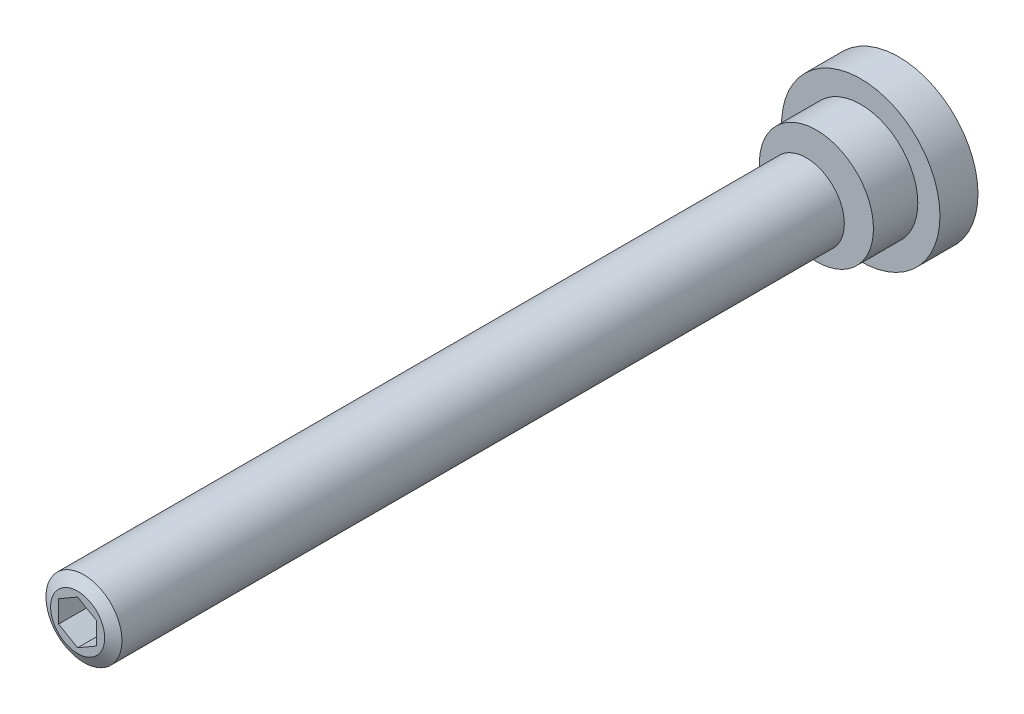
ISO-10303-21;
HEADER;
FILE_DESCRIPTION(('STEP AP214'),'2;1');
FILE_NAME('part.step','',(''),(''),'','','');
FILE_SCHEMA(('AUTOMOTIVE_DESIGN { 1 0 10303 214 1 1 1 1 }'));
ENDSEC;
DATA;
#1=APPLICATION_CONTEXT('core data for automotive mechanical design processes');
#2=APPLICATION_PROTOCOL_DEFINITION('international standard','automotive_design',2000,#1);
#3=PRODUCT_CONTEXT('',#1,'mechanical');
#4=PRODUCT('Part','Part','',(#3));
#5=PRODUCT_RELATED_PRODUCT_CATEGORY('part','',(#4));
#6=PRODUCT_DEFINITION_FORMATION('','',#4);
#7=PRODUCT_DEFINITION_CONTEXT('part definition',#1,'design');
#8=PRODUCT_DEFINITION('design','',#6,#7);
#9=PRODUCT_DEFINITION_SHAPE('','',#8);
#10=(LENGTH_UNIT() NAMED_UNIT(*) SI_UNIT(.MILLI.,.METRE.));
#11=(NAMED_UNIT(*) PLANE_ANGLE_UNIT() SI_UNIT($,.RADIAN.));
#12=(NAMED_UNIT(*) SI_UNIT($,.STERADIAN.) SOLID_ANGLE_UNIT());
#13=UNCERTAINTY_MEASURE_WITH_UNIT(LENGTH_MEASURE(1.E-05),#10,'distance_accuracy_value','');
#14=(GEOMETRIC_REPRESENTATION_CONTEXT(3) GLOBAL_UNCERTAINTY_ASSIGNED_CONTEXT((#13)) GLOBAL_UNIT_ASSIGNED_CONTEXT((#10,
#11,#12)) REPRESENTATION_CONTEXT('',''));
#15=CARTESIAN_POINT('',(0.,0.,0.));
#16=DIRECTION('',(0.,0.,1.));
#17=DIRECTION('',(1.,0.,0.));
#18=AXIS2_PLACEMENT_3D('',#15,#16,#17);
#19=CARTESIAN_POINT('',(-6.,0.,13.));
#20=DIRECTION('',(0.,0.,1.));
#21=DIRECTION('',(1.,0.,0.));
#22=AXIS2_PLACEMENT_3D('',#19,#20,#21);
#23=PLANE('',#22);
#24=CARTESIAN_POINT('',(0.,0.,13.));
#25=DIRECTION('',(0.,0.,1.));
#26=DIRECTION('',(1.,0.,0.));
#27=AXIS2_PLACEMENT_3D('',#24,#25,#26);
#28=CIRCLE('',#27,9.);
#29=CARTESIAN_POINT('',(9.,0.,13.));
#30=VERTEX_POINT('',#29);
#31=EDGE_CURVE('E131',#30,#30,#28,.T.);
#32=ORIENTED_EDGE('',*,*,#31,.T.);
#33=EDGE_LOOP('',(#32));
#34=FACE_BOUND('',#33,.T.);
#35=CARTESIAN_POINT('',(0.,0.,13.));
#36=DIRECTION('',(0.,0.,-1.));
#37=DIRECTION('',(-1.,0.,0.));
#38=AXIS2_PLACEMENT_3D('',#35,#36,#37);
#39=CIRCLE('',#38,3.6);
#40=CARTESIAN_POINT('',(-3.6,0.,13.));
#41=VERTEX_POINT('',#40);
#42=EDGE_CURVE('E314',#41,#41,#39,.T.);
#43=ORIENTED_EDGE('',*,*,#42,.T.);
#44=EDGE_LOOP('',(#43));
#45=FACE_BOUND('',#44,.T.);
#46=ADVANCED_FACE('F14',(#34,#45),#23,.T.);
#47=CARTESIAN_POINT('',(0.,0.,30.));
#48=DIRECTION('',(0.,0.,1.));
#49=DIRECTION('',(1.,0.,0.));
#50=AXIS2_PLACEMENT_3D('',#47,#48,#49);
#51=CYLINDRICAL_SURFACE('',#50,9.);
#52=CARTESIAN_POINT('',(0.,0.,6.));
#53=DIRECTION('',(0.,0.,1.));
#54=DIRECTION('',(1.,0.,0.));
#55=AXIS2_PLACEMENT_3D('',#52,#53,#54);
#56=CIRCLE('',#55,9.);
#57=CARTESIAN_POINT('',(9.,0.,6.));
#58=VERTEX_POINT('',#57);
#59=EDGE_CURVE('E128',#58,#58,#56,.T.);
#60=ORIENTED_EDGE('',*,*,#59,.T.);
#61=EDGE_LOOP('',(#60));
#62=FACE_BOUND('',#61,.T.);
#63=ORIENTED_EDGE('',*,*,#31,.F.);
#64=EDGE_LOOP('',(#63));
#65=FACE_BOUND('',#64,.T.);
#66=ADVANCED_FACE('F149',(#62,#65),#51,.T.);
#67=CARTESIAN_POINT('',(-9.,0.,6.));
#68=DIRECTION('',(0.,0.,1.));
#69=DIRECTION('',(1.,0.,0.));
#70=AXIS2_PLACEMENT_3D('',#67,#68,#69);
#71=PLANE('',#70);
#72=CARTESIAN_POINT('',(0.,0.,6.));
#73=DIRECTION('',(0.,0.,1.));
#74=DIRECTION('',(1.,0.,0.));
#75=AXIS2_PLACEMENT_3D('',#72,#73,#74);
#76=CIRCLE('',#75,12.5);
#77=CARTESIAN_POINT('',(12.5,0.,6.));
#78=VERTEX_POINT('',#77);
#79=EDGE_CURVE('E125',#78,#78,#76,.T.);
#80=ORIENTED_EDGE('',*,*,#79,.T.);
#81=EDGE_LOOP('',(#80));
#82=FACE_BOUND('',#81,.T.);
#83=ORIENTED_EDGE('',*,*,#59,.F.);
#84=EDGE_LOOP('',(#83));
#85=FACE_BOUND('',#84,.T.);
#86=ADVANCED_FACE('F156',(#82,#85),#71,.T.);
#87=CARTESIAN_POINT('',(0.,0.,30.));
#88=DIRECTION('',(0.,0.,1.));
#89=DIRECTION('',(1.,0.,0.));
#90=AXIS2_PLACEMENT_3D('',#87,#88,#89);
#91=CYLINDRICAL_SURFACE('',#90,12.5);
#92=CARTESIAN_POINT('',(0.,0.,0.));
#93=DIRECTION('',(0.,0.,1.));
#94=DIRECTION('',(1.,0.,0.));
#95=AXIS2_PLACEMENT_3D('',#92,#93,#94);
#96=CIRCLE('',#95,12.5);
#97=CARTESIAN_POINT('',(12.5,0.,0.));
#98=VERTEX_POINT('',#97);
#99=EDGE_CURVE('E116',#98,#98,#96,.T.);
#100=ORIENTED_EDGE('',*,*,#99,.T.);
#101=EDGE_LOOP('',(#100));
#102=FACE_BOUND('',#101,.T.);
#103=ORIENTED_EDGE('',*,*,#79,.F.);
#104=EDGE_LOOP('',(#103));
#105=FACE_BOUND('',#104,.T.);
#106=ADVANCED_FACE('F182',(#102,#105),#91,.T.);
#107=CARTESIAN_POINT('',(-12.5,0.,0.));
#108=DIRECTION('',(0.,0.,-1.));
#109=DIRECTION('',(-1.,0.,0.));
#110=AXIS2_PLACEMENT_3D('',#107,#108,#109);
#111=PLANE('',#110);
#112=ORIENTED_EDGE('',*,*,#99,.F.);
#113=EDGE_LOOP('',(#112));
#114=FACE_BOUND('',#113,.T.);
#115=ADVANCED_FACE('F178',(#114),#111,.T.);
#116=CARTESIAN_POINT('',(0.,0.,0.));
#117=DIRECTION('',(0.,0.,-1.));
#118=DIRECTION('',(-1.,0.,0.));
#119=AXIS2_PLACEMENT_3D('',#116,#117,#118);
#120=CYLINDRICAL_SURFACE('',#119,3.6);
#121=ORIENTED_EDGE('',*,*,#42,.F.);
#122=EDGE_LOOP('',(#121));
#123=FACE_BOUND('',#122,.T.);
#124=CARTESIAN_POINT('',(0.,0.,13.2143593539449));
#125=DIRECTION('',(0.,0.,-1.));
#126=DIRECTION('',(-1.,0.,0.));
#127=AXIS2_PLACEMENT_3D('',#124,#125,#126);
#128=CIRCLE('',#127,3.6);
#129=CARTESIAN_POINT('',(-3.6,0.,13.2143593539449));
#130=VERTEX_POINT('',#129);
#131=EDGE_CURVE('E316',#130,#130,#128,.T.);
#132=ORIENTED_EDGE('',*,*,#131,.T.);
#133=EDGE_LOOP('',(#132));
#134=FACE_BOUND('',#133,.T.);
#135=ADVANCED_FACE('F181',(#123,#134),#120,.T.);
#136=CARTESIAN_POINT('',(0.,0.,14.6));
#137=DIRECTION('',(0.,0.,1.));
#138=DIRECTION('',(1.,0.,0.));
#139=AXIS2_PLACEMENT_3D('',#136,#137,#138);
#140=CONICAL_SURFACE('',#139,6.,1.0471975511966);
#141=ORIENTED_EDGE('',*,*,#131,.F.);
#142=EDGE_LOOP('',(#141));
#143=FACE_BOUND('',#142,.T.);
#144=CARTESIAN_POINT('',(0.,0.,14.6));
#145=DIRECTION('',(0.,0.,-1.));
#146=DIRECTION('',(-1.,0.,0.));
#147=AXIS2_PLACEMENT_3D('',#144,#145,#146);
#148=CIRCLE('',#147,6.);
#149=CARTESIAN_POINT('',(-6.,0.,14.6));
#150=VERTEX_POINT('',#149);
#151=EDGE_CURVE('E321',#150,#150,#148,.T.);
#152=ORIENTED_EDGE('',*,*,#151,.T.);
#153=EDGE_LOOP('',(#152));
#154=FACE_BOUND('',#153,.T.);
#155=ADVANCED_FACE('F221',(#143,#154),#140,.T.);
#156=CARTESIAN_POINT('',(-3.,5.19615242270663,124.6));
#157=DIRECTION('',(0.,0.,1.));
#158=DIRECTION('',(1.,0.,0.));
#159=AXIS2_PLACEMENT_3D('',#156,#157,#158);
#160=PLANE('',#159);
#161=DIRECTION('',(-0.866025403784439,0.5,0.));
#162=VECTOR('',#161,1.);
#163=CARTESIAN_POINT('',(3.,1.73205080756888,124.6));
#164=LINE('',#163,#162);
#165=CARTESIAN_POINT('',(3.,1.73205080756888,124.6));
#166=VERTEX_POINT('',#165);
#167=CARTESIAN_POINT('',(0.,3.46410161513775,124.6));
#168=VERTEX_POINT('',#167);
#169=EDGE_CURVE('E100',#166,#168,#164,.T.);
#170=ORIENTED_EDGE('',*,*,#169,.T.);
#171=DIRECTION('',(-0.866025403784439,-0.5,0.));
#172=VECTOR('',#171,1.);
#173=CARTESIAN_POINT('',(0.,3.46410161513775,124.6));
#174=LINE('',#173,#172);
#175=CARTESIAN_POINT('',(-3.,1.73205080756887,124.6));
#176=VERTEX_POINT('',#175);
#177=EDGE_CURVE('E103',#168,#176,#174,.T.);
#178=ORIENTED_EDGE('',*,*,#177,.T.);
#179=DIRECTION('',(0.,-1.,0.));
#180=VECTOR('',#179,1.);
#181=CARTESIAN_POINT('',(-3.,1.73205080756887,124.6));
#182=LINE('',#181,#180);
#183=CARTESIAN_POINT('',(-3.,-1.73205080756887,124.6));
#184=VERTEX_POINT('',#183);
#185=EDGE_CURVE('E75',#176,#184,#182,.T.);
#186=ORIENTED_EDGE('',*,*,#185,.T.);
#187=DIRECTION('',(0.866025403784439,-0.5,0.));
#188=VECTOR('',#187,1.);
#189=CARTESIAN_POINT('',(-3.,-1.73205080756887,124.6));
#190=LINE('',#189,#188);
#191=CARTESIAN_POINT('',(0.,-3.46410161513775,124.6));
#192=VERTEX_POINT('',#191);
#193=EDGE_CURVE('E106',#184,#192,#190,.T.);
#194=ORIENTED_EDGE('',*,*,#193,.T.);
#195=DIRECTION('',(0.866025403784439,0.5,0.));
#196=VECTOR('',#195,1.);
#197=CARTESIAN_POINT('',(0.,-3.46410161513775,124.6));
#198=LINE('',#197,#196);
#199=CARTESIAN_POINT('',(3.,-1.73205080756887,124.6));
#200=VERTEX_POINT('',#199);
#201=EDGE_CURVE('E109',#192,#200,#198,.T.);
#202=ORIENTED_EDGE('',*,*,#201,.T.);
#203=DIRECTION('',(0.,1.,0.));
#204=VECTOR('',#203,1.);
#205=CARTESIAN_POINT('',(3.,-1.73205080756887,124.6));
#206=LINE('',#205,#204);
#207=EDGE_CURVE('E112',#200,#166,#206,.T.);
#208=ORIENTED_EDGE('',*,*,#207,.T.);
#209=EDGE_LOOP('',(#170,#178,#186,#194,#202,#208));
#210=FACE_BOUND('',#209,.T.);
#211=ADVANCED_FACE('F230',(#210),#160,.T.);
#212=CARTESIAN_POINT('',(0.,3.46410161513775,124.6));
#213=DIRECTION('',(-0.5,0.866025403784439,0.));
#214=DIRECTION('',(-0.866025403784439,-0.5,0.));
#215=AXIS2_PLACEMENT_3D('',#212,#213,#214);
#216=PLANE('',#215);
#217=DIRECTION('',(-0.866025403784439,-0.5,0.));
#218=VECTOR('',#217,1.);
#219=CARTESIAN_POINT('',(0.,3.46410161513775,129.6));
#220=LINE('',#219,#218);
#221=CARTESIAN_POINT('',(0.,3.46410161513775,129.6));
#222=VERTEX_POINT('',#221);
#223=CARTESIAN_POINT('',(-3.,1.73205080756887,129.6));
#224=VERTEX_POINT('',#223);
#225=EDGE_CURVE('E83',#222,#224,#220,.T.);
#226=ORIENTED_EDGE('',*,*,#225,.T.);
#227=DIRECTION('',(0.,0.,1.));
#228=VECTOR('',#227,1.);
#229=CARTESIAN_POINT('',(-3.,1.73205080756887,124.6));
#230=LINE('',#229,#228);
#231=EDGE_CURVE('E68',#176,#224,#230,.T.);
#232=ORIENTED_EDGE('',*,*,#231,.F.);
#233=ORIENTED_EDGE('',*,*,#177,.F.);
#234=DIRECTION('',(0.,0.,1.));
#235=VECTOR('',#234,1.);
#236=CARTESIAN_POINT('',(0.,3.46410161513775,124.6));
#237=LINE('',#236,#235);
#238=EDGE_CURVE('E80',#168,#222,#237,.T.);
#239=ORIENTED_EDGE('',*,*,#238,.T.);
#240=EDGE_LOOP('',(#226,#232,#233,#239));
#241=FACE_BOUND('',#240,.T.);
#242=ADVANCED_FACE('F84',(#241),#216,.F.);
#243=CARTESIAN_POINT('',(-3.,1.73205080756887,124.6));
#244=DIRECTION('',(-1.,0.,0.));
#245=DIRECTION('',(0.,0.,1.));
#246=AXIS2_PLACEMENT_3D('',#243,#244,#245);
#247=PLANE('',#246);
#248=DIRECTION('',(0.,-1.,0.));
#249=VECTOR('',#248,1.);
#250=CARTESIAN_POINT('',(-3.,1.73205080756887,129.6));
#251=LINE('',#250,#249);
#252=CARTESIAN_POINT('',(-3.,-1.73205080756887,129.6));
#253=VERTEX_POINT('',#252);
#254=EDGE_CURVE('E72',#224,#253,#251,.T.);
#255=ORIENTED_EDGE('',*,*,#254,.T.);
#256=DIRECTION('',(0.,0.,1.));
#257=VECTOR('',#256,1.);
#258=CARTESIAN_POINT('',(-3.,-1.73205080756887,124.6));
#259=LINE('',#258,#257);
#260=EDGE_CURVE('E79',#184,#253,#259,.T.);
#261=ORIENTED_EDGE('',*,*,#260,.F.);
#262=ORIENTED_EDGE('',*,*,#185,.F.);
#263=ORIENTED_EDGE('',*,*,#231,.T.);
#264=EDGE_LOOP('',(#255,#261,#262,#263));
#265=FACE_BOUND('',#264,.T.);
#266=ADVANCED_FACE('F70',(#265),#247,.F.);
#267=CARTESIAN_POINT('',(-3.,-1.73205080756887,124.6));
#268=DIRECTION('',(-0.5,-0.866025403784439,0.));
#269=DIRECTION('',(0.866025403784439,-0.5,0.));
#270=AXIS2_PLACEMENT_3D('',#267,#268,#269);
#271=PLANE('',#270);
#272=DIRECTION('',(0.866025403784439,-0.5,0.));
#273=VECTOR('',#272,1.);
#274=CARTESIAN_POINT('',(-3.,-1.73205080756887,129.6));
#275=LINE('',#274,#273);
#276=CARTESIAN_POINT('',(0.,-3.46410161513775,129.6));
#277=VERTEX_POINT('',#276);
#278=EDGE_CURVE('E90',#253,#277,#275,.T.);
#279=ORIENTED_EDGE('',*,*,#278,.T.);
#280=DIRECTION('',(0.,0.,1.));
#281=VECTOR('',#280,1.);
#282=CARTESIAN_POINT('',(0.,-3.46410161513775,124.6));
#283=LINE('',#282,#281);
#284=EDGE_CURVE('E119',#192,#277,#283,.T.);
#285=ORIENTED_EDGE('',*,*,#284,.F.);
#286=ORIENTED_EDGE('',*,*,#193,.F.);
#287=ORIENTED_EDGE('',*,*,#260,.T.);
#288=EDGE_LOOP('',(#279,#285,#286,#287));
#289=FACE_BOUND('',#288,.T.);
#290=ADVANCED_FACE('F253',(#289),#271,.F.);
#291=CARTESIAN_POINT('',(0.,-3.46410161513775,124.6));
#292=DIRECTION('',(0.5,-0.866025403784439,0.));
#293=DIRECTION('',(0.866025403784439,0.5,0.));
#294=AXIS2_PLACEMENT_3D('',#291,#292,#293);
#295=PLANE('',#294);
#296=DIRECTION('',(0.866025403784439,0.5,0.));
#297=VECTOR('',#296,1.);
#298=CARTESIAN_POINT('',(0.,-3.46410161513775,129.6));
#299=LINE('',#298,#297);
#300=CARTESIAN_POINT('',(3.,-1.73205080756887,129.6));
#301=VERTEX_POINT('',#300);
#302=EDGE_CURVE('E92',#277,#301,#299,.T.);
#303=ORIENTED_EDGE('',*,*,#302,.T.);
#304=DIRECTION('',(0.,0.,1.));
#305=VECTOR('',#304,1.);
#306=CARTESIAN_POINT('',(3.,-1.73205080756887,124.6));
#307=LINE('',#306,#305);
#308=EDGE_CURVE('E117',#200,#301,#307,.T.);
#309=ORIENTED_EDGE('',*,*,#308,.F.);
#310=ORIENTED_EDGE('',*,*,#201,.F.);
#311=ORIENTED_EDGE('',*,*,#284,.T.);
#312=EDGE_LOOP('',(#303,#309,#310,#311));
#313=FACE_BOUND('',#312,.T.);
#314=ADVANCED_FACE('F173',(#313),#295,.F.);
#315=CARTESIAN_POINT('',(3.,-1.73205080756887,124.6));
#316=DIRECTION('',(1.,0.,0.));
#317=DIRECTION('',(0.,0.,-1.));
#318=AXIS2_PLACEMENT_3D('',#315,#316,#317);
#319=PLANE('',#318);
#320=DIRECTION('',(0.,1.,0.));
#321=VECTOR('',#320,1.);
#322=CARTESIAN_POINT('',(3.,-1.73205080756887,129.6));
#323=LINE('',#322,#321);
#324=CARTESIAN_POINT('',(3.,1.73205080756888,129.6));
#325=VERTEX_POINT('',#324);
#326=EDGE_CURVE('E98',#301,#325,#323,.T.);
#327=ORIENTED_EDGE('',*,*,#326,.T.);
#328=DIRECTION('',(0.,0.,1.));
#329=VECTOR('',#328,1.);
#330=CARTESIAN_POINT('',(3.,1.73205080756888,124.6));
#331=LINE('',#330,#329);
#332=EDGE_CURVE('E36',#166,#325,#331,.T.);
#333=ORIENTED_EDGE('',*,*,#332,.F.);
#334=ORIENTED_EDGE('',*,*,#207,.F.);
#335=ORIENTED_EDGE('',*,*,#308,.T.);
#336=EDGE_LOOP('',(#327,#333,#334,#335));
#337=FACE_BOUND('',#336,.T.);
#338=ADVANCED_FACE('F167',(#337),#319,.F.);
#339=CARTESIAN_POINT('',(3.,1.73205080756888,124.6));
#340=DIRECTION('',(0.5,0.866025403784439,0.));
#341=DIRECTION('',(-0.866025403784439,0.5,0.));
#342=AXIS2_PLACEMENT_3D('',#339,#340,#341);
#343=PLANE('',#342);
#344=DIRECTION('',(-0.866025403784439,0.5,0.));
#345=VECTOR('',#344,1.);
#346=CARTESIAN_POINT('',(3.,1.73205080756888,129.6));
#347=LINE('',#346,#345);
#348=EDGE_CURVE('E29',#325,#222,#347,.T.);
#349=ORIENTED_EDGE('',*,*,#348,.T.);
#350=ORIENTED_EDGE('',*,*,#238,.F.);
#351=ORIENTED_EDGE('',*,*,#169,.F.);
#352=ORIENTED_EDGE('',*,*,#332,.T.);
#353=EDGE_LOOP('',(#349,#350,#351,#352));
#354=FACE_BOUND('',#353,.T.);
#355=ADVANCED_FACE('F162',(#354),#343,.F.);
#356=CARTESIAN_POINT('',(0.,0.,129.6));
#357=DIRECTION('',(0.,0.,1.));
#358=DIRECTION('',(1.,0.,0.));
#359=AXIS2_PLACEMENT_3D('',#356,#357,#358);
#360=PLANE('',#359);
#361=CARTESIAN_POINT('',(0.,0.,129.6));
#362=DIRECTION('',(0.,0.,1.));
#363=DIRECTION('',(1.,0.,0.));
#364=AXIS2_PLACEMENT_3D('',#361,#362,#363);
#365=CIRCLE('',#364,4.26794919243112);
#366=CARTESIAN_POINT('',(4.26794919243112,0.,129.6));
#367=VERTEX_POINT('',#366);
#368=EDGE_CURVE('E22',#367,#367,#365,.T.);
#369=ORIENTED_EDGE('',*,*,#368,.T.);
#370=EDGE_LOOP('',(#369));
#371=FACE_BOUND('',#370,.T.);
#372=ORIENTED_EDGE('',*,*,#348,.F.);
#373=ORIENTED_EDGE('',*,*,#326,.F.);
#374=ORIENTED_EDGE('',*,*,#302,.F.);
#375=ORIENTED_EDGE('',*,*,#278,.F.);
#376=ORIENTED_EDGE('',*,*,#254,.F.);
#377=ORIENTED_EDGE('',*,*,#225,.F.);
#378=EDGE_LOOP('',(#372,#373,#374,#375,#376,#377));
#379=FACE_BOUND('',#378,.T.);
#380=ADVANCED_FACE('F87',(#371,#379),#360,.T.);
#381=CARTESIAN_POINT('',(0.,0.,30.));
#382=DIRECTION('',(0.,0.,1.));
#383=DIRECTION('',(1.,0.,0.));
#384=AXIS2_PLACEMENT_3D('',#381,#382,#383);
#385=CYLINDRICAL_SURFACE('',#384,6.);
#386=CARTESIAN_POINT('',(0.,0.,128.6));
#387=DIRECTION('',(0.,0.,1.));
#388=DIRECTION('',(1.,0.,0.));
#389=AXIS2_PLACEMENT_3D('',#386,#387,#388);
#390=CIRCLE('',#389,6.);
#391=CARTESIAN_POINT('',(6.,0.,128.6));
#392=VERTEX_POINT('',#391);
#393=EDGE_CURVE('E9',#392,#392,#390,.F.);
#394=ORIENTED_EDGE('',*,*,#393,.T.);
#395=EDGE_LOOP('',(#394));
#396=FACE_BOUND('',#395,.T.);
#397=ORIENTED_EDGE('',*,*,#151,.F.);
#398=EDGE_LOOP('',(#397));
#399=FACE_BOUND('',#398,.T.);
#400=ADVANCED_FACE('F138',(#396,#399),#385,.T.);
#401=CARTESIAN_POINT('',(0.,0.,129.6));
#402=DIRECTION('',(0.,0.,-1.));
#403=DIRECTION('',(-1.,0.,0.));
#404=AXIS2_PLACEMENT_3D('',#401,#402,#403);
#405=CONICAL_SURFACE('',#404,4.26794919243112,1.0471975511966);
#406=ORIENTED_EDGE('',*,*,#393,.F.);
#407=EDGE_LOOP('',(#406));
#408=FACE_BOUND('',#407,.T.);
#409=ORIENTED_EDGE('',*,*,#368,.F.);
#410=EDGE_LOOP('',(#409));
#411=FACE_BOUND('',#410,.T.);
#412=ADVANCED_FACE('F16',(#408,#411),#405,.T.);
#413=CLOSED_SHELL('',(#46,#66,#86,#106,#115,#135,#155,#211,#242,#266,#290,#314,#338,#355,#380,
#400,#412));
#414=MANIFOLD_SOLID_BREP('B1',#413);
#415=ADVANCED_BREP_SHAPE_REPRESENTATION('',(#18,#414),#14);
#416=SHAPE_DEFINITION_REPRESENTATION(#9,#415);
ENDSEC;
END-ISO-10303-21;
